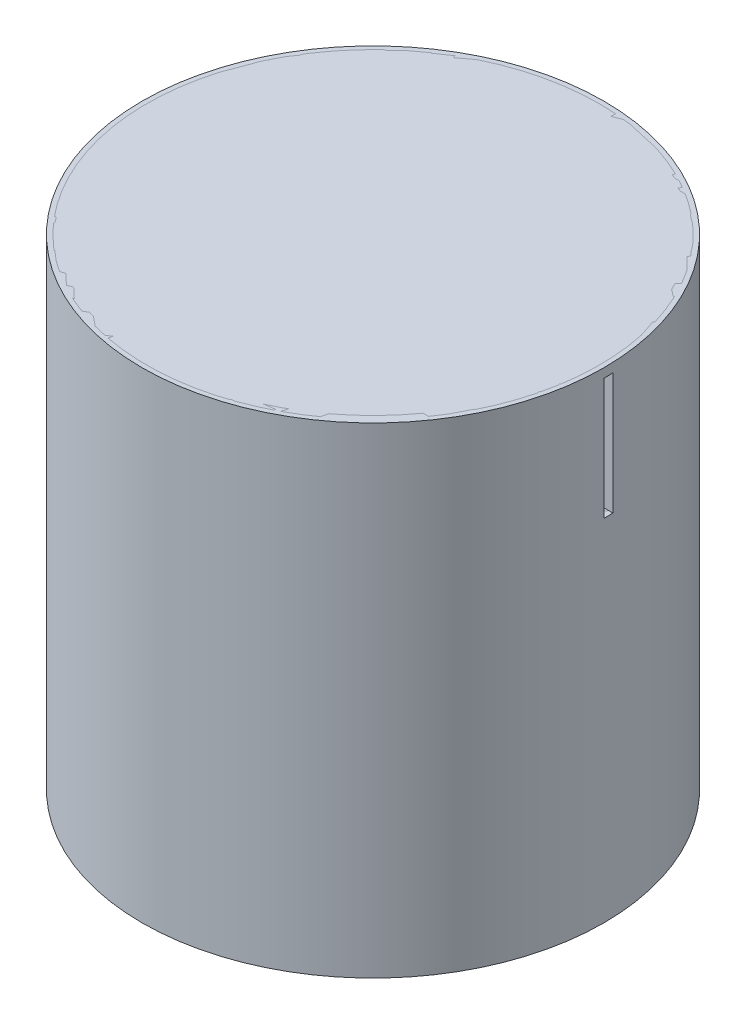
from build123d import *

# Parameters (mm, degrees)
SCHIZZO62_11_W           = 1.2
SCHIZZO62_11_H           = 2.4
SCHIZZO62_27_W           = 20.75
SCHIZZO62_27_H           = 1.2
SCHIZZO62_28_W           = 1.2
SCHIZZO62_28_H           = 2.4
SCHIZZO62_34_W           = 58.5
SCHIZZO62_34_H           = 2.4
SCHIZZO62_34_W_2         = 1.2
TAGLIO_ESTRUSIONE1_DEPTH = 32


with BuildPart() as part:
    # Schizzo62_11 → Rivoluzione17 (revolve)
    with BuildSketch(Plane.XY, mode=Mode.PRIVATE) as rivoluzione17_sk:
        with Locations((59.1, 35.6)):
            Rectangle(SCHIZZO62_11_W, SCHIZZO62_11_H)
        with Locations((60.3, 35.6)):
            Rectangle(SCHIZZO62_11_W, SCHIZZO62_11_H)
        Polygon((59.7, 34.4), (58.5, 34.4), (58.5, 21.9), (58.5, 2.4), (59.7, 2.4), (60.9, 2.4), (60.9, 34.4), align=None)
        with Locations((59.1, 1.2)):
            Rectangle(SCHIZZO62_11_W, SCHIZZO62_11_H)
        with Locations((60.3, 1.2)):
            Rectangle(SCHIZZO62_11_W, SCHIZZO62_11_H)
        Polygon((59.7, 0), (58.5, 0), (58.5, -90), (60.9, -90), (60.9, 0), align=None)
    revolve(rivoluzione17_sk.sketch.rotate(Axis((0, 14.4, 0), (0, 1, 0)), 90), axis=Axis((0, 14.4, 0), (0, 1, 0)))

    # Schizzo1 → Taglio-Estrusione1 (cut)
    with BuildSketch(Plane(origin=(0, 34.4, 0), x_dir=(1, 0, 0), z_dir=(0, 1, 0))):
        with BuildLine():
            Line((60.852690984, 2.4), (58.450748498, 2.4))
            ThreePointArc((58.450748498, 2.4), (58.487685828, 1.200252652), (58.5, 0))
            Line((58.5, 0), (60.9, 0))
            ThreePointArc((60.9, 0), (60.888171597, 1.200233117), (60.852690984, 2.4))
        make_face()
    extrude(amount=-TAGLIO_ESTRUSIONE1_DEPTH, mode=Mode.SUBTRACT)


with BuildPart() as body_2:
    # Schizzo62_27 → Rivoluzione26 (revolve)
    with BuildSketch(Plane.XY, mode=Mode.PRIVATE) as rivoluzione26_sk:
        with Locations((10.375, 35)):
            Rectangle(SCHIZZO62_27_W, SCHIZZO62_27_H)
    revolve(rivoluzione26_sk.sketch.rotate(Axis((0, 36.8, 0), (0, -1, 0)), 180), axis=Axis((0, 36.8, 0), (0, -1, 0)))


with BuildPart() as body_3:
    # Schizzo62_28 → Rivoluzione27 (revolve)
    with BuildSketch(Plane.XY, mode=Mode.PRIVATE) as rivoluzione27_sk:
        Polygon((20.75, 34.4), (58.5, 34.4), (58.5, 36.8), (0, 36.8), (0, 35.6), (20.75, 35.6), align=None)
        with Locations((59.1, 35.6)):
            Rectangle(SCHIZZO62_28_W, SCHIZZO62_28_H)
    revolve(rivoluzione27_sk.sketch.rotate(Axis((0, 14.4, 0), (0, 1, 0)), 90), axis=Axis((0, 14.4, 0), (0, 1, 0)))


with BuildPart() as body_4:
    # Schizzo62_34 → Rivoluzione29 (revolve)
    with BuildSketch(Plane.XY, mode=Mode.PRIVATE) as rivoluzione29_sk:
        with Locations((29.25, 1.2)):
            Rectangle(SCHIZZO62_34_W, SCHIZZO62_34_H)
        with Locations((59.1, 1.2)):
            Rectangle(SCHIZZO62_34_W_2, SCHIZZO62_34_H)
    revolve(rivoluzione29_sk.sketch.rotate(Axis((0, 2.4, 0), (0, -1, 0)), 180), axis=Axis((0, 2.4, 0), (0, -1, 0)))


solid = Compound([part.part, body_2.part, body_3.part, body_4.part])
